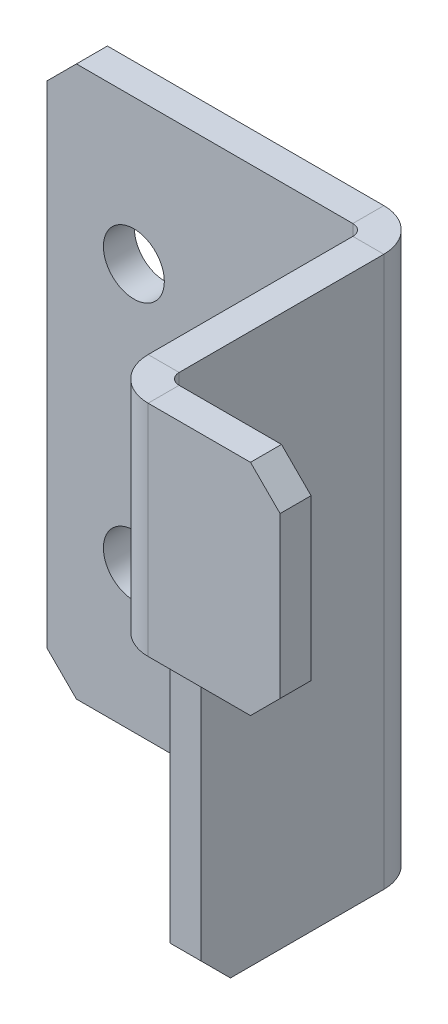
ISO-10303-21;
HEADER;
FILE_DESCRIPTION(('STEP AP214'),'2;1');
FILE_NAME('part.step','',(''),(''),'','','');
FILE_SCHEMA(('AUTOMOTIVE_DESIGN { 1 0 10303 214 1 1 1 1 }'));
ENDSEC;
DATA;
#1=APPLICATION_CONTEXT('core data for automotive mechanical design processes');
#2=APPLICATION_PROTOCOL_DEFINITION('international standard','automotive_design',2000,#1);
#3=PRODUCT_CONTEXT('',#1,'mechanical');
#4=PRODUCT('Part','Part','',(#3));
#5=PRODUCT_RELATED_PRODUCT_CATEGORY('part','',(#4));
#6=PRODUCT_DEFINITION_FORMATION('','',#4);
#7=PRODUCT_DEFINITION_CONTEXT('part definition',#1,'design');
#8=PRODUCT_DEFINITION('design','',#6,#7);
#9=PRODUCT_DEFINITION_SHAPE('','',#8);
#10=(LENGTH_UNIT() NAMED_UNIT(*) SI_UNIT(.MILLI.,.METRE.));
#11=(NAMED_UNIT(*) PLANE_ANGLE_UNIT() SI_UNIT($,.RADIAN.));
#12=(NAMED_UNIT(*) SI_UNIT($,.STERADIAN.) SOLID_ANGLE_UNIT());
#13=UNCERTAINTY_MEASURE_WITH_UNIT(LENGTH_MEASURE(1.E-05),#10,'distance_accuracy_value','');
#14=(GEOMETRIC_REPRESENTATION_CONTEXT(3) GLOBAL_UNCERTAINTY_ASSIGNED_CONTEXT((#13)) GLOBAL_UNIT_ASSIGNED_CONTEXT((#10,
#11,#12)) REPRESENTATION_CONTEXT('',''));
#15=CARTESIAN_POINT('',(0.,0.,0.));
#16=DIRECTION('',(0.,0.,1.));
#17=DIRECTION('',(1.,0.,0.));
#18=AXIS2_PLACEMENT_3D('',#15,#16,#17);
#19=CARTESIAN_POINT('',(12.7,-20.066,2.26060000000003));
#20=DIRECTION('',(0.,1.,0.));
#21=DIRECTION('',(0.,0.,1.));
#22=AXIS2_PLACEMENT_3D('',#19,#20,#21);
#23=PLANE('',#22);
#24=DIRECTION('',(0.,0.,-1.));
#25=VECTOR('',#24,1.);
#26=CARTESIAN_POINT('',(12.7,-20.066,0.));
#27=LINE('',#26,#25);
#28=CARTESIAN_POINT('',(12.7,-20.066,14.2621000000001));
#29=VERTEX_POINT('',#28);
#30=CARTESIAN_POINT('',(12.7,-20.066,3.07340000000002));
#31=VERTEX_POINT('',#30);
#32=EDGE_CURVE('E319',#29,#31,#27,.T.);
#33=ORIENTED_EDGE('',*,*,#32,.F.);
#34=DIRECTION('',(-1.,0.,0.));
#35=VECTOR('',#34,1.);
#36=CARTESIAN_POINT('',(12.7,-20.066,14.2621000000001));
#37=LINE('',#36,#35);
#38=CARTESIAN_POINT('',(10.4394,-20.066,14.2621000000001));
#39=VERTEX_POINT('',#38);
#40=EDGE_CURVE('E379',#29,#39,#37,.T.);
#41=ORIENTED_EDGE('',*,*,#40,.T.);
#42=DIRECTION('',(0.,0.,1.));
#43=VECTOR('',#42,1.);
#44=CARTESIAN_POINT('',(10.4394,-20.066,2.26060000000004));
#45=LINE('',#44,#43);
#46=CARTESIAN_POINT('',(10.4394,-20.066,3.07340000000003));
#47=VERTEX_POINT('',#46);
#48=EDGE_CURVE('E315',#39,#47,#45,.F.);
#49=ORIENTED_EDGE('',*,*,#48,.T.);
#50=DIRECTION('',(1.,0.,0.));
#51=VECTOR('',#50,1.);
#52=CARTESIAN_POINT('',(12.7,-20.066,3.07340000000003));
#53=LINE('',#52,#51);
#54=EDGE_CURVE('E332',#47,#31,#53,.T.);
#55=ORIENTED_EDGE('',*,*,#54,.T.);
#56=EDGE_LOOP('',(#33,#41,#49,#55));
#57=FACE_BOUND('',#56,.T.);
#58=ADVANCED_FACE('F82',(#57),#23,.F.);
#59=CARTESIAN_POINT('',(12.7,20.066,21.082));
#60=DIRECTION('',(0.,-1.,0.));
#61=DIRECTION('',(0.,0.,-1.));
#62=AXIS2_PLACEMENT_3D('',#59,#60,#61);
#63=PLANE('',#62);
#64=DIRECTION('',(-1.,0.,0.));
#65=VECTOR('',#64,1.);
#66=CARTESIAN_POINT('',(12.7,20.066,18.0086));
#67=LINE('',#66,#65);
#68=CARTESIAN_POINT('',(12.7,20.066,18.0086));
#69=VERTEX_POINT('',#68);
#70=CARTESIAN_POINT('',(10.4394,20.066,18.0086));
#71=VERTEX_POINT('',#70);
#72=EDGE_CURVE('E342',#69,#71,#67,.T.);
#73=ORIENTED_EDGE('',*,*,#72,.F.);
#74=DIRECTION('',(0.,0.,1.));
#75=VECTOR('',#74,1.);
#76=CARTESIAN_POINT('',(12.7,20.066,0.));
#77=LINE('',#76,#75);
#78=CARTESIAN_POINT('',(12.7,20.066,3.07340000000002));
#79=VERTEX_POINT('',#78);
#80=EDGE_CURVE('E316',#79,#69,#77,.T.);
#81=ORIENTED_EDGE('',*,*,#80,.F.);
#82=DIRECTION('',(1.,0.,0.));
#83=VECTOR('',#82,1.);
#84=CARTESIAN_POINT('',(10.4394,20.066,3.07340000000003));
#85=LINE('',#84,#83);
#86=CARTESIAN_POINT('',(10.4394,20.066,3.0734));
#87=VERTEX_POINT('',#86);
#88=EDGE_CURVE('E326',#87,#79,#85,.T.);
#89=ORIENTED_EDGE('',*,*,#88,.F.);
#90=DIRECTION('',(0.,0.,-1.));
#91=VECTOR('',#90,1.);
#92=CARTESIAN_POINT('',(10.4394,20.066,21.082));
#93=LINE('',#92,#91);
#94=EDGE_CURVE('E321',#87,#71,#93,.F.);
#95=ORIENTED_EDGE('',*,*,#94,.T.);
#96=EDGE_LOOP('',(#73,#81,#89,#95));
#97=FACE_BOUND('',#96,.T.);
#98=ADVANCED_FACE('F444',(#97),#63,.F.);
#99=CARTESIAN_POINT('',(12.7,0.,0.));
#100=DIRECTION('',(-1.,0.,0.));
#101=DIRECTION('',(0.,0.,1.));
#102=AXIS2_PLACEMENT_3D('',#99,#100,#101);
#103=PLANE('',#102);
#104=DIRECTION('',(0.,-1.,0.));
#105=VECTOR('',#104,1.);
#106=CARTESIAN_POINT('',(12.7000000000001,-20.066,16.4211000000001));
#107=LINE('',#106,#105);
#108=CARTESIAN_POINT('',(12.7000000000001,2.47650000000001,16.4211000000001));
#109=VERTEX_POINT('',#108);
#110=CARTESIAN_POINT('',(12.7000000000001,-17.907,16.4211000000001));
#111=VERTEX_POINT('',#110);
#112=EDGE_CURVE('E307',#109,#111,#107,.T.);
#113=ORIENTED_EDGE('',*,*,#112,.T.);
#114=DIRECTION('',(0.,0.707106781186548,0.707106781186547));
#115=VECTOR('',#114,1.);
#116=CARTESIAN_POINT('',(12.7,-20.066,14.2621000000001));
#117=LINE('',#116,#115);
#118=EDGE_CURVE('E13',#111,#29,#117,.F.);
#119=ORIENTED_EDGE('',*,*,#118,.T.);
#120=ORIENTED_EDGE('',*,*,#32,.T.);
#121=DIRECTION('',(0.,-1.,0.));
#122=VECTOR('',#121,1.);
#123=CARTESIAN_POINT('',(12.7,-20.066,3.07340000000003));
#124=LINE('',#123,#122);
#125=EDGE_CURVE('E329',#79,#31,#124,.T.);
#126=ORIENTED_EDGE('',*,*,#125,.F.);
#127=ORIENTED_EDGE('',*,*,#80,.T.);
#128=DIRECTION('',(0.,1.,0.));
#129=VECTOR('',#128,1.);
#130=CARTESIAN_POINT('',(12.7000000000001,-20.066,18.0086));
#131=LINE('',#130,#129);
#132=CARTESIAN_POINT('',(12.7000000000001,4.06400000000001,18.0086000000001));
#133=VERTEX_POINT('',#132);
#134=EDGE_CURVE('E339',#133,#69,#131,.T.);
#135=ORIENTED_EDGE('',*,*,#134,.F.);
#136=CARTESIAN_POINT('',(12.7000000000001,2.47650000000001,18.0086000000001));
#137=DIRECTION('',(-1.,0.,0.));
#138=DIRECTION('',(0.,0.,1.));
#139=AXIS2_PLACEMENT_3D('',#136,#137,#138);
#140=CIRCLE('',#139,1.5875);
#141=EDGE_CURVE('E304',#133,#109,#140,.T.);
#142=ORIENTED_EDGE('',*,*,#141,.T.);
#143=EDGE_LOOP('',(#113,#119,#120,#126,#127,#135,#142));
#144=FACE_BOUND('',#143,.T.);
#145=ADVANCED_FACE('F449',(#144),#103,.F.);
#146=CARTESIAN_POINT('',(10.4394,0.,0.));
#147=DIRECTION('',(-1.,0.,0.));
#148=DIRECTION('',(0.,0.,1.));
#149=AXIS2_PLACEMENT_3D('',#146,#147,#148);
#150=PLANE('',#149);
#151=ORIENTED_EDGE('',*,*,#48,.F.);
#152=DIRECTION('',(0.,-0.707106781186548,-0.707106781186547));
#153=VECTOR('',#152,1.);
#154=CARTESIAN_POINT('',(10.4394,-17.16405,17.16405));
#155=LINE('',#154,#153);
#156=CARTESIAN_POINT('',(10.4394000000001,-17.907,16.4211000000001));
#157=VERTEX_POINT('',#156);
#158=EDGE_CURVE('E104',#39,#157,#155,.F.);
#159=ORIENTED_EDGE('',*,*,#158,.T.);
#160=DIRECTION('',(0.,-1.,0.));
#161=VECTOR('',#160,1.);
#162=CARTESIAN_POINT('',(10.4394000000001,-20.066,16.4211000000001));
#163=LINE('',#162,#161);
#164=CARTESIAN_POINT('',(10.4394000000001,2.47650000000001,16.4211000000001));
#165=VERTEX_POINT('',#164);
#166=EDGE_CURVE('E308',#165,#157,#163,.T.);
#167=ORIENTED_EDGE('',*,*,#166,.F.);
#168=CARTESIAN_POINT('',(10.4394000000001,2.47650000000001,18.0086000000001));
#169=DIRECTION('',(-1.,0.,0.));
#170=DIRECTION('',(0.,0.,1.));
#171=AXIS2_PLACEMENT_3D('',#168,#169,#170);
#172=CIRCLE('',#171,1.5875);
#173=CARTESIAN_POINT('',(10.4394000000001,4.06400000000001,18.0086000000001));
#174=VERTEX_POINT('',#173);
#175=EDGE_CURVE('E278',#174,#165,#172,.T.);
#176=ORIENTED_EDGE('',*,*,#175,.F.);
#177=DIRECTION('',(0.,1.,0.));
#178=VECTOR('',#177,1.);
#179=CARTESIAN_POINT('',(10.4394000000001,-20.066,18.0086000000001));
#180=LINE('',#179,#178);
#181=EDGE_CURVE('E253',#174,#71,#180,.T.);
#182=ORIENTED_EDGE('',*,*,#181,.T.);
#183=ORIENTED_EDGE('',*,*,#94,.F.);
#184=DIRECTION('',(0.,1.,0.));
#185=VECTOR('',#184,1.);
#186=CARTESIAN_POINT('',(10.4394,-20.066,3.07340000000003));
#187=LINE('',#186,#185);
#188=EDGE_CURVE('E318',#47,#87,#187,.T.);
#189=ORIENTED_EDGE('',*,*,#188,.F.);
#190=EDGE_LOOP('',(#151,#159,#167,#176,#182,#183,#189));
#191=FACE_BOUND('',#190,.T.);
#192=ADVANCED_FACE('F388',(#191),#150,.T.);
#193=CARTESIAN_POINT('',(12.7000000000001,-20.066,16.4211000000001));
#194=DIRECTION('',(0.,0.,-1.));
#195=DIRECTION('',(-1.,0.,0.));
#196=AXIS2_PLACEMENT_3D('',#193,#194,#195);
#197=PLANE('',#196);
#198=ORIENTED_EDGE('',*,*,#166,.T.);
#199=DIRECTION('',(1.,0.,0.));
#200=VECTOR('',#199,1.);
#201=CARTESIAN_POINT('',(12.7000000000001,-17.907,16.4211000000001));
#202=LINE('',#201,#200);
#203=EDGE_CURVE('E90',#157,#111,#202,.T.);
#204=ORIENTED_EDGE('',*,*,#203,.T.);
#205=ORIENTED_EDGE('',*,*,#112,.F.);
#206=DIRECTION('',(-1.,0.,0.));
#207=VECTOR('',#206,1.);
#208=CARTESIAN_POINT('',(12.7000000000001,2.47650000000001,16.4211000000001));
#209=LINE('',#208,#207);
#210=EDGE_CURVE('E310',#109,#165,#209,.T.);
#211=ORIENTED_EDGE('',*,*,#210,.T.);
#212=EDGE_LOOP('',(#198,#204,#205,#211));
#213=FACE_BOUND('',#212,.T.);
#214=ADVANCED_FACE('F472',(#213),#197,.F.);
#215=CARTESIAN_POINT('',(12.7000000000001,2.47650000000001,18.0086000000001));
#216=DIRECTION('',(-1.,0.,0.));
#217=DIRECTION('',(0.,0.,1.));
#218=AXIS2_PLACEMENT_3D('',#215,#216,#217);
#219=CYLINDRICAL_SURFACE('',#218,1.5875);
#220=ORIENTED_EDGE('',*,*,#175,.T.);
#221=ORIENTED_EDGE('',*,*,#210,.F.);
#222=ORIENTED_EDGE('',*,*,#141,.F.);
#223=DIRECTION('',(-1.,0.,0.));
#224=VECTOR('',#223,1.);
#225=CARTESIAN_POINT('',(12.7000000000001,4.06400000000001,18.0086000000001));
#226=LINE('',#225,#224);
#227=EDGE_CURVE('E336',#133,#174,#226,.T.);
#228=ORIENTED_EDGE('',*,*,#227,.T.);
#229=EDGE_LOOP('',(#220,#221,#222,#228));
#230=FACE_BOUND('',#229,.T.);
#231=ADVANCED_FACE('F474',(#230),#219,.F.);
#232=CARTESIAN_POINT('',(-12.7,20.066,2.2606));
#233=DIRECTION('',(1.,0.,0.));
#234=DIRECTION('',(0.,0.,-1.));
#235=AXIS2_PLACEMENT_3D('',#232,#233,#234);
#236=PLANE('',#235);
#237=DIRECTION('',(0.,-1.,0.));
#238=VECTOR('',#237,1.);
#239=CARTESIAN_POINT('',(-12.7,20.066,0.));
#240=LINE('',#239,#238);
#241=CARTESIAN_POINT('',(-12.7,17.907,0.));
#242=VERTEX_POINT('',#241);
#243=CARTESIAN_POINT('',(-12.7,-17.907,0.));
#244=VERTEX_POINT('',#243);
#245=EDGE_CURVE('E296',#242,#244,#240,.T.);
#246=ORIENTED_EDGE('',*,*,#245,.T.);
#247=DIRECTION('',(0.,0.,1.));
#248=VECTOR('',#247,1.);
#249=CARTESIAN_POINT('',(-12.7,-17.907,2.2606));
#250=LINE('',#249,#248);
#251=CARTESIAN_POINT('',(-12.7,-17.907,2.2606));
#252=VERTEX_POINT('',#251);
#253=EDGE_CURVE('E375',#244,#252,#250,.T.);
#254=ORIENTED_EDGE('',*,*,#253,.T.);
#255=DIRECTION('',(0.,-1.,0.));
#256=VECTOR('',#255,1.);
#257=CARTESIAN_POINT('',(-12.7,20.066,2.2606));
#258=LINE('',#257,#256);
#259=CARTESIAN_POINT('',(-12.7,17.907,2.2606));
#260=VERTEX_POINT('',#259);
#261=EDGE_CURVE('E288',#260,#252,#258,.T.);
#262=ORIENTED_EDGE('',*,*,#261,.F.);
#263=DIRECTION('',(0.,0.,-1.));
#264=VECTOR('',#263,1.);
#265=CARTESIAN_POINT('',(-12.7,17.907,2.2606));
#266=LINE('',#265,#264);
#267=EDGE_CURVE('E361',#260,#242,#266,.T.);
#268=ORIENTED_EDGE('',*,*,#267,.T.);
#269=EDGE_LOOP('',(#246,#254,#262,#268));
#270=FACE_BOUND('',#269,.T.);
#271=ADVANCED_FACE('F415',(#270),#236,.F.);
#272=CARTESIAN_POINT('',(-12.7,-20.066,2.2606));
#273=DIRECTION('',(0.,0.,1.));
#274=DIRECTION('',(1.,0.,0.));
#275=AXIS2_PLACEMENT_3D('',#272,#273,#274);
#276=PLANE('',#275);
#277=CARTESIAN_POINT('',(-6.35000000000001,-9.525,2.2606));
#278=DIRECTION('',(0.,0.,1.));
#279=DIRECTION('',(1.,0.,0.));
#280=AXIS2_PLACEMENT_3D('',#277,#278,#279);
#281=CIRCLE('',#280,2.2225);
#282=CARTESIAN_POINT('',(-4.12750000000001,-9.525,2.2606));
#283=VERTEX_POINT('',#282);
#284=EDGE_CURVE('E499',#283,#283,#281,.T.);
#285=ORIENTED_EDGE('',*,*,#284,.F.);
#286=EDGE_LOOP('',(#285));
#287=FACE_BOUND('',#286,.T.);
#288=CARTESIAN_POINT('',(-6.35000000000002,9.525,2.2606));
#289=DIRECTION('',(0.,0.,1.));
#290=DIRECTION('',(1.,0.,0.));
#291=AXIS2_PLACEMENT_3D('',#288,#289,#290);
#292=CIRCLE('',#291,2.2225);
#293=CARTESIAN_POINT('',(-4.12750000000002,9.525,2.2606));
#294=VERTEX_POINT('',#293);
#295=EDGE_CURVE('E502',#294,#294,#292,.T.);
#296=ORIENTED_EDGE('',*,*,#295,.F.);
#297=EDGE_LOOP('',(#296));
#298=FACE_BOUND('',#297,.T.);
#299=ORIENTED_EDGE('',*,*,#261,.T.);
#300=DIRECTION('',(-0.707106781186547,0.707106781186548,0.));
#301=VECTOR('',#300,1.);
#302=CARTESIAN_POINT('',(-11.6205,-18.9865,2.2606));
#303=LINE('',#302,#301);
#304=CARTESIAN_POINT('',(-10.541,-20.066,2.2606));
#305=VERTEX_POINT('',#304);
#306=EDGE_CURVE('E377',#252,#305,#303,.F.);
#307=ORIENTED_EDGE('',*,*,#306,.T.);
#308=DIRECTION('',(1.,0.,0.));
#309=VECTOR('',#308,1.);
#310=CARTESIAN_POINT('',(-12.7,-20.066,2.2606));
#311=LINE('',#310,#309);
#312=CARTESIAN_POINT('',(9.6266,-20.066,2.2606));
#313=VERTEX_POINT('',#312);
#314=EDGE_CURVE('E294',#305,#313,#311,.T.);
#315=ORIENTED_EDGE('',*,*,#314,.T.);
#316=DIRECTION('',(0.,-1.,0.));
#317=VECTOR('',#316,1.);
#318=CARTESIAN_POINT('',(9.6266,20.066,2.26060000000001));
#319=LINE('',#318,#317);
#320=CARTESIAN_POINT('',(9.6266,20.066,2.26060000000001));
#321=VERTEX_POINT('',#320);
#322=EDGE_CURVE('E272',#321,#313,#319,.T.);
#323=ORIENTED_EDGE('',*,*,#322,.F.);
#324=DIRECTION('',(-1.,0.,0.));
#325=VECTOR('',#324,1.);
#326=CARTESIAN_POINT('',(-12.7,20.066,2.2606));
#327=LINE('',#326,#325);
#328=CARTESIAN_POINT('',(-10.541,20.066,2.2606));
#329=VERTEX_POINT('',#328);
#330=EDGE_CURVE('E291',#321,#329,#327,.T.);
#331=ORIENTED_EDGE('',*,*,#330,.T.);
#332=DIRECTION('',(0.707106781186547,0.707106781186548,0.));
#333=VECTOR('',#332,1.);
#334=CARTESIAN_POINT('',(-31.6865,-1.07950000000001,2.2606));
#335=LINE('',#334,#333);
#336=EDGE_CURVE('E368',#329,#260,#335,.F.);
#337=ORIENTED_EDGE('',*,*,#336,.T.);
#338=EDGE_LOOP('',(#299,#307,#315,#323,#331,#337));
#339=FACE_BOUND('',#338,.T.);
#340=ADVANCED_FACE('F402',(#287,#298,#339),#276,.T.);
#341=CARTESIAN_POINT('',(-12.7,20.066,2.2606));
#342=DIRECTION('',(0.,-1.,0.));
#343=DIRECTION('',(0.,0.,-1.));
#344=AXIS2_PLACEMENT_3D('',#341,#342,#343);
#345=PLANE('',#344);
#346=DIRECTION('',(-1.,0.,0.));
#347=VECTOR('',#346,1.);
#348=CARTESIAN_POINT('',(-12.7,20.066,0.));
#349=LINE('',#348,#347);
#350=CARTESIAN_POINT('',(9.6266,20.066,0.));
#351=VERTEX_POINT('',#350);
#352=CARTESIAN_POINT('',(-10.541,20.066,0.));
#353=VERTEX_POINT('',#352);
#354=EDGE_CURVE('E282',#351,#353,#349,.T.);
#355=ORIENTED_EDGE('',*,*,#354,.T.);
#356=DIRECTION('',(0.,0.,1.));
#357=VECTOR('',#356,1.);
#358=CARTESIAN_POINT('',(-10.541,20.066,2.2606));
#359=LINE('',#358,#357);
#360=EDGE_CURVE('E366',#353,#329,#359,.T.);
#361=ORIENTED_EDGE('',*,*,#360,.T.);
#362=ORIENTED_EDGE('',*,*,#330,.F.);
#363=DIRECTION('',(0.,0.,-1.));
#364=VECTOR('',#363,1.);
#365=CARTESIAN_POINT('',(9.6266,20.066,2.26060000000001));
#366=LINE('',#365,#364);
#367=EDGE_CURVE('E285',#321,#351,#366,.T.);
#368=ORIENTED_EDGE('',*,*,#367,.T.);
#369=EDGE_LOOP('',(#355,#361,#362,#368));
#370=FACE_BOUND('',#369,.T.);
#371=ADVANCED_FACE('F406',(#370),#345,.F.);
#372=CARTESIAN_POINT('',(-12.7,-20.066,0.));
#373=DIRECTION('',(0.,0.,1.));
#374=DIRECTION('',(1.,0.,0.));
#375=AXIS2_PLACEMENT_3D('',#372,#373,#374);
#376=PLANE('',#375);
#377=CARTESIAN_POINT('',(-6.35000000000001,-9.525,0.));
#378=DIRECTION('',(0.,0.,1.));
#379=DIRECTION('',(1.,0.,0.));
#380=AXIS2_PLACEMENT_3D('',#377,#378,#379);
#381=CIRCLE('',#380,2.2225);
#382=CARTESIAN_POINT('',(-4.12750000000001,-9.525,0.));
#383=VERTEX_POINT('',#382);
#384=EDGE_CURVE('E504',#383,#383,#381,.T.);
#385=ORIENTED_EDGE('',*,*,#384,.T.);
#386=EDGE_LOOP('',(#385));
#387=FACE_BOUND('',#386,.T.);
#388=CARTESIAN_POINT('',(-6.35000000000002,9.525,0.));
#389=DIRECTION('',(0.,0.,1.));
#390=DIRECTION('',(1.,0.,0.));
#391=AXIS2_PLACEMENT_3D('',#388,#389,#390);
#392=CIRCLE('',#391,2.2225);
#393=CARTESIAN_POINT('',(-4.12750000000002,9.525,0.));
#394=VERTEX_POINT('',#393);
#395=EDGE_CURVE('E238',#394,#394,#392,.T.);
#396=ORIENTED_EDGE('',*,*,#395,.T.);
#397=EDGE_LOOP('',(#396));
#398=FACE_BOUND('',#397,.T.);
#399=DIRECTION('',(1.,0.,0.));
#400=VECTOR('',#399,1.);
#401=CARTESIAN_POINT('',(-12.7,-20.066,0.));
#402=LINE('',#401,#400);
#403=CARTESIAN_POINT('',(-10.541,-20.066,0.));
#404=VERTEX_POINT('',#403);
#405=CARTESIAN_POINT('',(9.6266,-20.066,0.));
#406=VERTEX_POINT('',#405);
#407=EDGE_CURVE('E276',#404,#406,#402,.T.);
#408=ORIENTED_EDGE('',*,*,#407,.F.);
#409=DIRECTION('',(0.707106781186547,-0.707106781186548,0.));
#410=VECTOR('',#409,1.);
#411=CARTESIAN_POINT('',(-10.541,-20.066,0.));
#412=LINE('',#411,#410);
#413=EDGE_CURVE('E373',#404,#244,#412,.F.);
#414=ORIENTED_EDGE('',*,*,#413,.T.);
#415=ORIENTED_EDGE('',*,*,#245,.F.);
#416=DIRECTION('',(-0.707106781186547,-0.707106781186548,0.));
#417=VECTOR('',#416,1.);
#418=CARTESIAN_POINT('',(-12.7,17.907,0.));
#419=LINE('',#418,#417);
#420=EDGE_CURVE('E364',#242,#353,#419,.F.);
#421=ORIENTED_EDGE('',*,*,#420,.T.);
#422=ORIENTED_EDGE('',*,*,#354,.F.);
#423=DIRECTION('',(0.,-1.,0.));
#424=VECTOR('',#423,1.);
#425=CARTESIAN_POINT('',(9.6266,20.066,0.));
#426=LINE('',#425,#424);
#427=EDGE_CURVE('E279',#351,#406,#426,.T.);
#428=ORIENTED_EDGE('',*,*,#427,.T.);
#429=EDGE_LOOP('',(#408,#414,#415,#421,#422,#428));
#430=FACE_BOUND('',#429,.T.);
#431=ADVANCED_FACE('F430',(#387,#398,#430),#376,.F.);
#432=CARTESIAN_POINT('',(-12.7,-20.066,2.2606));
#433=DIRECTION('',(0.,1.,0.));
#434=DIRECTION('',(0.,0.,1.));
#435=AXIS2_PLACEMENT_3D('',#432,#433,#434);
#436=PLANE('',#435);
#437=ORIENTED_EDGE('',*,*,#314,.F.);
#438=DIRECTION('',(0.,0.,-1.));
#439=VECTOR('',#438,1.);
#440=CARTESIAN_POINT('',(-10.541,-20.066,2.2606));
#441=LINE('',#440,#439);
#442=EDGE_CURVE('E370',#305,#404,#441,.T.);
#443=ORIENTED_EDGE('',*,*,#442,.T.);
#444=ORIENTED_EDGE('',*,*,#407,.T.);
#445=DIRECTION('',(0.,0.,-1.));
#446=VECTOR('',#445,1.);
#447=CARTESIAN_POINT('',(9.6266,-20.066,2.2606));
#448=LINE('',#447,#446);
#449=EDGE_CURVE('E299',#313,#406,#448,.T.);
#450=ORIENTED_EDGE('',*,*,#449,.F.);
#451=EDGE_LOOP('',(#437,#443,#444,#450));
#452=FACE_BOUND('',#451,.T.);
#453=ADVANCED_FACE('F422',(#452),#436,.F.);
#454=CARTESIAN_POINT('',(9.6266,20.066,3.07340000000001));
#455=DIRECTION('',(0.,-1.,0.));
#456=DIRECTION('',(0.,0.,-1.));
#457=AXIS2_PLACEMENT_3D('',#454,#455,#456);
#458=PLANE('',#457);
#459=ORIENTED_EDGE('',*,*,#88,.T.);
#460=CARTESIAN_POINT('',(9.6266,20.066,3.07340000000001));
#461=DIRECTION('',(0.,1.,0.));
#462=DIRECTION('',(0.,0.,1.));
#463=AXIS2_PLACEMENT_3D('',#460,#461,#462);
#464=CIRCLE('',#463,3.0734);
#465=EDGE_CURVE('E257',#79,#351,#464,.T.);
#466=ORIENTED_EDGE('',*,*,#465,.T.);
#467=ORIENTED_EDGE('',*,*,#367,.F.);
#468=CARTESIAN_POINT('',(9.6266,20.066,3.07340000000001));
#469=DIRECTION('',(0.,1.,0.));
#470=DIRECTION('',(0.,0.,1.));
#471=AXIS2_PLACEMENT_3D('',#468,#469,#470);
#472=CIRCLE('',#471,0.8128);
#473=EDGE_CURVE('E265',#87,#321,#472,.T.);
#474=ORIENTED_EDGE('',*,*,#473,.F.);
#475=EDGE_LOOP('',(#459,#466,#467,#474));
#476=FACE_BOUND('',#475,.T.);
#477=ADVANCED_FACE('F438',(#476),#458,.F.);
#478=CARTESIAN_POINT('',(9.6266,-20.066,3.0734));
#479=DIRECTION('',(0.,1.,0.));
#480=DIRECTION('',(0.,0.,1.));
#481=AXIS2_PLACEMENT_3D('',#478,#479,#480);
#482=PLANE('',#481);
#483=CARTESIAN_POINT('',(9.6266,-20.066,3.0734));
#484=DIRECTION('',(0.,1.,0.));
#485=DIRECTION('',(0.,0.,1.));
#486=AXIS2_PLACEMENT_3D('',#483,#484,#485);
#487=CIRCLE('',#486,3.0734);
#488=EDGE_CURVE('E269',#406,#31,#487,.F.);
#489=ORIENTED_EDGE('',*,*,#488,.T.);
#490=ORIENTED_EDGE('',*,*,#54,.F.);
#491=CARTESIAN_POINT('',(9.6266,-20.066,3.0734));
#492=DIRECTION('',(0.,-1.,0.));
#493=DIRECTION('',(0.,0.,-1.));
#494=AXIS2_PLACEMENT_3D('',#491,#492,#493);
#495=CIRCLE('',#494,0.812800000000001);
#496=EDGE_CURVE('E268',#313,#47,#495,.T.);
#497=ORIENTED_EDGE('',*,*,#496,.F.);
#498=ORIENTED_EDGE('',*,*,#449,.T.);
#499=EDGE_LOOP('',(#489,#490,#497,#498));
#500=FACE_BOUND('',#499,.T.);
#501=ADVANCED_FACE('F395',(#500),#482,.F.);
#502=CARTESIAN_POINT('',(9.6266,-40.2799981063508,3.07339999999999));
#503=DIRECTION('',(0.,1.,0.));
#504=DIRECTION('',(0.,0.,1.));
#505=AXIS2_PLACEMENT_3D('',#502,#503,#504);
#506=CYLINDRICAL_SURFACE('',#505,0.8128);
#507=ORIENTED_EDGE('',*,*,#322,.T.);
#508=ORIENTED_EDGE('',*,*,#496,.T.);
#509=ORIENTED_EDGE('',*,*,#188,.T.);
#510=ORIENTED_EDGE('',*,*,#473,.T.);
#511=EDGE_LOOP('',(#507,#508,#509,#510));
#512=FACE_BOUND('',#511,.T.);
#513=ADVANCED_FACE('F398',(#512),#506,.F.);
#514=CARTESIAN_POINT('',(9.6266,-40.2799981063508,3.07339999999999));
#515=DIRECTION('',(0.,1.,0.));
#516=DIRECTION('',(0.,0.,1.));
#517=AXIS2_PLACEMENT_3D('',#514,#515,#516);
#518=CYLINDRICAL_SURFACE('',#517,3.0734);
#519=ORIENTED_EDGE('',*,*,#427,.F.);
#520=ORIENTED_EDGE('',*,*,#465,.F.);
#521=ORIENTED_EDGE('',*,*,#125,.T.);
#522=ORIENTED_EDGE('',*,*,#488,.F.);
#523=EDGE_LOOP('',(#519,#520,#521,#522));
#524=FACE_BOUND('',#523,.T.);
#525=ADVANCED_FACE('F426',(#524),#518,.T.);
#526=CARTESIAN_POINT('',(13.5128,4.06400000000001,18.0086));
#527=DIRECTION('',(0.,-1.,0.));
#528=DIRECTION('',(0.,0.,-1.));
#529=AXIS2_PLACEMENT_3D('',#526,#527,#528);
#530=PLANE('',#529);
#531=ORIENTED_EDGE('',*,*,#227,.F.);
#532=CARTESIAN_POINT('',(13.5128,4.06400000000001,18.0086));
#533=DIRECTION('',(0.,1.,0.));
#534=DIRECTION('',(0.,0.,1.));
#535=AXIS2_PLACEMENT_3D('',#532,#533,#534);
#536=CIRCLE('',#535,0.8128);
#537=CARTESIAN_POINT('',(13.5128000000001,4.06400000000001,18.8214));
#538=VERTEX_POINT('',#537);
#539=EDGE_CURVE('E248',#133,#538,#536,.T.);
#540=ORIENTED_EDGE('',*,*,#539,.T.);
#541=DIRECTION('',(0.,0.,1.));
#542=VECTOR('',#541,1.);
#543=CARTESIAN_POINT('',(13.5128000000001,4.06400000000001,18.8214));
#544=LINE('',#543,#542);
#545=CARTESIAN_POINT('',(13.5128000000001,4.06400000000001,21.082));
#546=VERTEX_POINT('',#545);
#547=EDGE_CURVE('E219',#538,#546,#544,.T.);
#548=ORIENTED_EDGE('',*,*,#547,.T.);
#549=CARTESIAN_POINT('',(13.5128,4.06400000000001,18.0086));
#550=DIRECTION('',(0.,1.,0.));
#551=DIRECTION('',(0.,0.,-1.));
#552=AXIS2_PLACEMENT_3D('',#549,#550,#551);
#553=CIRCLE('',#552,3.0734);
#554=EDGE_CURVE('E245',#174,#546,#553,.T.);
#555=ORIENTED_EDGE('',*,*,#554,.F.);
#556=EDGE_LOOP('',(#531,#540,#548,#555));
#557=FACE_BOUND('',#556,.T.);
#558=ADVANCED_FACE('F244',(#557),#530,.T.);
#559=CARTESIAN_POINT('',(13.5128,20.066,18.0086));
#560=DIRECTION('',(0.,1.,0.));
#561=DIRECTION('',(0.,0.,1.));
#562=AXIS2_PLACEMENT_3D('',#559,#560,#561);
#563=PLANE('',#562);
#564=DIRECTION('',(0.,0.,1.));
#565=VECTOR('',#564,1.);
#566=CARTESIAN_POINT('',(13.5128000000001,20.066,21.082));
#567=LINE('',#566,#565);
#568=CARTESIAN_POINT('',(13.5128000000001,20.066,18.8214));
#569=VERTEX_POINT('',#568);
#570=CARTESIAN_POINT('',(13.5128,20.066,21.082));
#571=VERTEX_POINT('',#570);
#572=EDGE_CURVE('E512',#569,#571,#567,.T.);
#573=ORIENTED_EDGE('',*,*,#572,.F.);
#574=CARTESIAN_POINT('',(13.5128,20.066,18.0086));
#575=DIRECTION('',(0.,1.,0.));
#576=DIRECTION('',(0.,0.,1.));
#577=AXIS2_PLACEMENT_3D('',#574,#575,#576);
#578=CIRCLE('',#577,0.8128);
#579=EDGE_CURVE('E255',#569,#69,#578,.F.);
#580=ORIENTED_EDGE('',*,*,#579,.T.);
#581=ORIENTED_EDGE('',*,*,#72,.T.);
#582=CARTESIAN_POINT('',(13.5128,20.066,18.0086));
#583=DIRECTION('',(0.,-1.,0.));
#584=DIRECTION('',(0.,0.,-1.));
#585=AXIS2_PLACEMENT_3D('',#582,#583,#584);
#586=CIRCLE('',#585,3.0734);
#587=EDGE_CURVE('E254',#571,#71,#586,.T.);
#588=ORIENTED_EDGE('',*,*,#587,.F.);
#589=EDGE_LOOP('',(#573,#580,#581,#588));
#590=FACE_BOUND('',#589,.T.);
#591=ADVANCED_FACE('F478',(#590),#563,.T.);
#592=CARTESIAN_POINT('',(13.5128,-4.30463125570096,18.0086));
#593=DIRECTION('',(0.,1.,0.));
#594=DIRECTION('',(0.,0.,1.));
#595=AXIS2_PLACEMENT_3D('',#592,#593,#594);
#596=CYLINDRICAL_SURFACE('',#595,3.0734);
#597=ORIENTED_EDGE('',*,*,#587,.T.);
#598=ORIENTED_EDGE('',*,*,#181,.F.);
#599=ORIENTED_EDGE('',*,*,#554,.T.);
#600=DIRECTION('',(0.,1.,0.));
#601=VECTOR('',#600,1.);
#602=CARTESIAN_POINT('',(13.5128000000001,20.066,21.082));
#603=LINE('',#602,#601);
#604=EDGE_CURVE('E228',#546,#571,#603,.T.);
#605=ORIENTED_EDGE('',*,*,#604,.T.);
#606=EDGE_LOOP('',(#597,#598,#599,#605));
#607=FACE_BOUND('',#606,.T.);
#608=ADVANCED_FACE('F251',(#607),#596,.T.);
#609=CARTESIAN_POINT('',(13.5128,-4.30463125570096,18.0086));
#610=DIRECTION('',(0.,1.,0.));
#611=DIRECTION('',(0.,0.,1.));
#612=AXIS2_PLACEMENT_3D('',#609,#610,#611);
#613=CYLINDRICAL_SURFACE('',#612,0.8128);
#614=ORIENTED_EDGE('',*,*,#579,.F.);
#615=DIRECTION('',(0.,-1.,0.));
#616=VECTOR('',#615,1.);
#617=CARTESIAN_POINT('',(13.5128000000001,20.066,18.8214));
#618=LINE('',#617,#616);
#619=EDGE_CURVE('E237',#569,#538,#618,.T.);
#620=ORIENTED_EDGE('',*,*,#619,.T.);
#621=ORIENTED_EDGE('',*,*,#539,.F.);
#622=ORIENTED_EDGE('',*,*,#134,.T.);
#623=EDGE_LOOP('',(#614,#620,#621,#622));
#624=FACE_BOUND('',#623,.T.);
#625=ADVANCED_FACE('F521',(#624),#613,.F.);
#626=CARTESIAN_POINT('',(23.1394000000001,20.066,21.082));
#627=DIRECTION('',(-1.,0.,0.));
#628=DIRECTION('',(0.,0.,1.));
#629=AXIS2_PLACEMENT_3D('',#626,#627,#628);
#630=PLANE('',#629);
#631=DIRECTION('',(0.,-1.,0.));
#632=VECTOR('',#631,1.);
#633=CARTESIAN_POINT('',(23.1394000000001,20.066,18.8214));
#634=LINE('',#633,#632);
#635=CARTESIAN_POINT('',(23.1394000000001,6.22300000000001,18.8214));
#636=VERTEX_POINT('',#635);
#637=CARTESIAN_POINT('',(23.1394000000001,17.907,18.8214));
#638=VERTEX_POINT('',#637);
#639=EDGE_CURVE('E249',#636,#638,#634,.F.);
#640=ORIENTED_EDGE('',*,*,#639,.T.);
#641=DIRECTION('',(0.,0.,1.));
#642=VECTOR('',#641,1.);
#643=CARTESIAN_POINT('',(23.1394000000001,17.907,21.082));
#644=LINE('',#643,#642);
#645=CARTESIAN_POINT('',(23.1394000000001,17.907,21.082));
#646=VERTEX_POINT('',#645);
#647=EDGE_CURVE('E357',#638,#646,#644,.T.);
#648=ORIENTED_EDGE('',*,*,#647,.T.);
#649=DIRECTION('',(0.,1.,0.));
#650=VECTOR('',#649,1.);
#651=CARTESIAN_POINT('',(23.1394000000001,0.,21.082));
#652=LINE('',#651,#650);
#653=CARTESIAN_POINT('',(23.1394000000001,6.22300000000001,21.082));
#654=VERTEX_POINT('',#653);
#655=EDGE_CURVE('E516',#654,#646,#652,.T.);
#656=ORIENTED_EDGE('',*,*,#655,.F.);
#657=DIRECTION('',(0.,0.,-1.));
#658=VECTOR('',#657,1.);
#659=CARTESIAN_POINT('',(23.1394000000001,6.22300000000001,21.082));
#660=LINE('',#659,#658);
#661=EDGE_CURVE('E348',#654,#636,#660,.T.);
#662=ORIENTED_EDGE('',*,*,#661,.T.);
#663=EDGE_LOOP('',(#640,#648,#656,#662));
#664=FACE_BOUND('',#663,.T.);
#665=ADVANCED_FACE('F533',(#664),#630,.F.);
#666=CARTESIAN_POINT('',(0.,0.,21.082));
#667=DIRECTION('',(0.,0.,-1.));
#668=DIRECTION('',(-1.,0.,0.));
#669=AXIS2_PLACEMENT_3D('',#666,#667,#668);
#670=PLANE('',#669);
#671=ORIENTED_EDGE('',*,*,#655,.T.);
#672=DIRECTION('',(0.707106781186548,-0.707106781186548,0.));
#673=VECTOR('',#672,1.);
#674=CARTESIAN_POINT('',(20.9804000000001,20.066,21.082));
#675=LINE('',#674,#673);
#676=CARTESIAN_POINT('',(20.9804000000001,20.066,21.082));
#677=VERTEX_POINT('',#676);
#678=EDGE_CURVE('E359',#646,#677,#675,.F.);
#679=ORIENTED_EDGE('',*,*,#678,.T.);
#680=DIRECTION('',(-1.,0.,0.));
#681=VECTOR('',#680,1.);
#682=CARTESIAN_POINT('',(0.,20.066,21.082));
#683=LINE('',#682,#681);
#684=EDGE_CURVE('E225',#677,#571,#683,.T.);
#685=ORIENTED_EDGE('',*,*,#684,.T.);
#686=ORIENTED_EDGE('',*,*,#604,.F.);
#687=DIRECTION('',(-1.,0.,0.));
#688=VECTOR('',#687,1.);
#689=CARTESIAN_POINT('',(23.1394000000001,4.06400000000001,21.082));
#690=LINE('',#689,#688);
#691=CARTESIAN_POINT('',(20.9804000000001,4.06400000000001,21.082));
#692=VERTEX_POINT('',#691);
#693=EDGE_CURVE('E214',#692,#546,#690,.T.);
#694=ORIENTED_EDGE('',*,*,#693,.F.);
#695=DIRECTION('',(-0.707106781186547,-0.707106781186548,0.));
#696=VECTOR('',#695,1.);
#697=CARTESIAN_POINT('',(20.9804000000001,4.06400000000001,21.082));
#698=LINE('',#697,#696);
#699=EDGE_CURVE('E346',#692,#654,#698,.F.);
#700=ORIENTED_EDGE('',*,*,#699,.T.);
#701=EDGE_LOOP('',(#671,#679,#685,#686,#694,#700));
#702=FACE_BOUND('',#701,.T.);
#703=ADVANCED_FACE('F230',(#702),#670,.F.);
#704=CARTESIAN_POINT('',(23.1394000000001,4.06400000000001,18.8214));
#705=DIRECTION('',(0.,1.,0.));
#706=DIRECTION('',(-1.,0.,0.));
#707=AXIS2_PLACEMENT_3D('',#704,#705,#706);
#708=PLANE('',#707);
#709=DIRECTION('',(-1.,0.,0.));
#710=VECTOR('',#709,1.);
#711=CARTESIAN_POINT('',(23.1394000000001,4.06400000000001,18.8214));
#712=LINE('',#711,#710);
#713=CARTESIAN_POINT('',(20.9804000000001,4.06400000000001,18.8214));
#714=VERTEX_POINT('',#713);
#715=EDGE_CURVE('E224',#714,#538,#712,.T.);
#716=ORIENTED_EDGE('',*,*,#715,.F.);
#717=DIRECTION('',(0.,0.,1.));
#718=VECTOR('',#717,1.);
#719=CARTESIAN_POINT('',(20.9804000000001,4.06400000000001,18.8214));
#720=LINE('',#719,#718);
#721=EDGE_CURVE('E222',#714,#692,#720,.T.);
#722=ORIENTED_EDGE('',*,*,#721,.T.);
#723=ORIENTED_EDGE('',*,*,#693,.T.);
#724=ORIENTED_EDGE('',*,*,#547,.F.);
#725=EDGE_LOOP('',(#716,#722,#723,#724));
#726=FACE_BOUND('',#725,.T.);
#727=ADVANCED_FACE('F217',(#726),#708,.F.);
#728=CARTESIAN_POINT('',(0.,0.,18.8214));
#729=DIRECTION('',(0.,0.,-1.));
#730=DIRECTION('',(-1.,0.,0.));
#731=AXIS2_PLACEMENT_3D('',#728,#729,#730);
#732=PLANE('',#731);
#733=DIRECTION('',(1.,0.,0.));
#734=VECTOR('',#733,1.);
#735=CARTESIAN_POINT('',(12.7000000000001,20.066,18.8214));
#736=LINE('',#735,#734);
#737=CARTESIAN_POINT('',(20.9804000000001,20.066,18.8214));
#738=VERTEX_POINT('',#737);
#739=EDGE_CURVE('E264',#738,#569,#736,.F.);
#740=ORIENTED_EDGE('',*,*,#739,.F.);
#741=DIRECTION('',(-0.707106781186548,0.707106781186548,0.));
#742=VECTOR('',#741,1.);
#743=CARTESIAN_POINT('',(20.5232,20.5232,18.8214));
#744=LINE('',#743,#742);
#745=EDGE_CURVE('E355',#738,#638,#744,.F.);
#746=ORIENTED_EDGE('',*,*,#745,.T.);
#747=ORIENTED_EDGE('',*,*,#639,.F.);
#748=DIRECTION('',(0.707106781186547,0.707106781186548,0.));
#749=VECTOR('',#748,1.);
#750=CARTESIAN_POINT('',(8.45820000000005,-8.45820000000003,18.8214));
#751=LINE('',#750,#749);
#752=EDGE_CURVE('E350',#636,#714,#751,.F.);
#753=ORIENTED_EDGE('',*,*,#752,.T.);
#754=ORIENTED_EDGE('',*,*,#715,.T.);
#755=ORIENTED_EDGE('',*,*,#619,.F.);
#756=EDGE_LOOP('',(#740,#746,#747,#753,#754,#755));
#757=FACE_BOUND('',#756,.T.);
#758=ADVANCED_FACE('F524',(#757),#732,.T.);
#759=CARTESIAN_POINT('',(12.7000000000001,20.066,21.082));
#760=DIRECTION('',(0.,-1.,0.));
#761=DIRECTION('',(0.,0.,-1.));
#762=AXIS2_PLACEMENT_3D('',#759,#760,#761);
#763=PLANE('',#762);
#764=ORIENTED_EDGE('',*,*,#684,.F.);
#765=DIRECTION('',(0.,0.,-1.));
#766=VECTOR('',#765,1.);
#767=CARTESIAN_POINT('',(20.9804000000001,20.066,21.082));
#768=LINE('',#767,#766);
#769=EDGE_CURVE('E352',#677,#738,#768,.T.);
#770=ORIENTED_EDGE('',*,*,#769,.T.);
#771=ORIENTED_EDGE('',*,*,#739,.T.);
#772=ORIENTED_EDGE('',*,*,#572,.T.);
#773=EDGE_LOOP('',(#764,#770,#771,#772));
#774=FACE_BOUND('',#773,.T.);
#775=ADVANCED_FACE('F526',(#774),#763,.F.);
#776=CARTESIAN_POINT('',(-6.35000000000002,9.525,0.));
#777=DIRECTION('',(0.,0.,1.));
#778=DIRECTION('',(1.,0.,0.));
#779=AXIS2_PLACEMENT_3D('',#776,#777,#778);
#780=CYLINDRICAL_SURFACE('',#779,2.2225);
#781=ORIENTED_EDGE('',*,*,#395,.F.);
#782=EDGE_LOOP('',(#781));
#783=FACE_BOUND('',#782,.T.);
#784=ORIENTED_EDGE('',*,*,#295,.T.);
#785=EDGE_LOOP('',(#784));
#786=FACE_BOUND('',#785,.T.);
#787=ADVANCED_FACE('F545',(#783,#786),#780,.F.);
#788=CARTESIAN_POINT('',(-6.35000000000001,-9.525,0.));
#789=DIRECTION('',(0.,0.,1.));
#790=DIRECTION('',(1.,0.,0.));
#791=AXIS2_PLACEMENT_3D('',#788,#789,#790);
#792=CYLINDRICAL_SURFACE('',#791,2.2225);
#793=ORIENTED_EDGE('',*,*,#384,.F.);
#794=EDGE_LOOP('',(#793));
#795=FACE_BOUND('',#794,.T.);
#796=ORIENTED_EDGE('',*,*,#284,.T.);
#797=EDGE_LOOP('',(#796));
#798=FACE_BOUND('',#797,.T.);
#799=ADVANCED_FACE('F458',(#795,#798),#792,.F.);
#800=CARTESIAN_POINT('',(20.9804000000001,4.06400000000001,18.8214));
#801=DIRECTION('',(-0.707106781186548,0.707106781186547,0.));
#802=DIRECTION('',(0.,0.,1.));
#803=AXIS2_PLACEMENT_3D('',#800,#801,#802);
#804=PLANE('',#803);
#805=ORIENTED_EDGE('',*,*,#752,.F.);
#806=ORIENTED_EDGE('',*,*,#661,.F.);
#807=ORIENTED_EDGE('',*,*,#699,.F.);
#808=ORIENTED_EDGE('',*,*,#721,.F.);
#809=EDGE_LOOP('',(#805,#806,#807,#808));
#810=FACE_BOUND('',#809,.T.);
#811=ADVANCED_FACE('F454',(#810),#804,.F.);
#812=CARTESIAN_POINT('',(20.9804000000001,20.066,21.082));
#813=DIRECTION('',(-0.707106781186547,-0.707106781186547,0.));
#814=DIRECTION('',(0.,0.,-1.));
#815=AXIS2_PLACEMENT_3D('',#812,#813,#814);
#816=PLANE('',#815);
#817=ORIENTED_EDGE('',*,*,#678,.F.);
#818=ORIENTED_EDGE('',*,*,#647,.F.);
#819=ORIENTED_EDGE('',*,*,#745,.F.);
#820=ORIENTED_EDGE('',*,*,#769,.F.);
#821=EDGE_LOOP('',(#817,#818,#819,#820));
#822=FACE_BOUND('',#821,.T.);
#823=ADVANCED_FACE('F457',(#822),#816,.F.);
#824=CARTESIAN_POINT('',(-12.7,17.907,2.2606));
#825=DIRECTION('',(0.707106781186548,-0.707106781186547,0.));
#826=DIRECTION('',(0.,0.,-1.));
#827=AXIS2_PLACEMENT_3D('',#824,#825,#826);
#828=PLANE('',#827);
#829=ORIENTED_EDGE('',*,*,#336,.F.);
#830=ORIENTED_EDGE('',*,*,#360,.F.);
#831=ORIENTED_EDGE('',*,*,#420,.F.);
#832=ORIENTED_EDGE('',*,*,#267,.F.);
#833=EDGE_LOOP('',(#829,#830,#831,#832));
#834=FACE_BOUND('',#833,.T.);
#835=ADVANCED_FACE('F410',(#834),#828,.F.);
#836=CARTESIAN_POINT('',(-10.541,-20.066,2.2606));
#837=DIRECTION('',(0.707106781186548,0.707106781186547,0.));
#838=DIRECTION('',(0.,0.,-1.));
#839=AXIS2_PLACEMENT_3D('',#836,#837,#838);
#840=PLANE('',#839);
#841=ORIENTED_EDGE('',*,*,#306,.F.);
#842=ORIENTED_EDGE('',*,*,#253,.F.);
#843=ORIENTED_EDGE('',*,*,#413,.F.);
#844=ORIENTED_EDGE('',*,*,#442,.F.);
#845=EDGE_LOOP('',(#841,#842,#843,#844));
#846=FACE_BOUND('',#845,.T.);
#847=ADVANCED_FACE('F419',(#846),#840,.F.);
#848=CARTESIAN_POINT('',(12.7,-20.066,14.2621000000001));
#849=DIRECTION('',(0.,0.707106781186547,-0.707106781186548));
#850=DIRECTION('',(-1.,0.,0.));
#851=AXIS2_PLACEMENT_3D('',#848,#849,#850);
#852=PLANE('',#851);
#853=ORIENTED_EDGE('',*,*,#118,.F.);
#854=ORIENTED_EDGE('',*,*,#203,.F.);
#855=ORIENTED_EDGE('',*,*,#158,.F.);
#856=ORIENTED_EDGE('',*,*,#40,.F.);
#857=EDGE_LOOP('',(#853,#854,#855,#856));
#858=FACE_BOUND('',#857,.T.);
#859=ADVANCED_FACE('F84',(#858),#852,.F.);
#860=CLOSED_SHELL('',(#58,#98,#145,#192,#214,#231,#271,#340,#371,#431,#453,#477,#501,#513,#525,
#558,#591,#608,#625,#665,#703,#727,#758,#775,#787,#799,#811,#823,#835,#847,#859));
#861=MANIFOLD_SOLID_BREP('B2',#860);
#862=ADVANCED_BREP_SHAPE_REPRESENTATION('',(#18,#861),#14);
#863=SHAPE_DEFINITION_REPRESENTATION(#9,#862);
ENDSEC;
END-ISO-10303-21;
